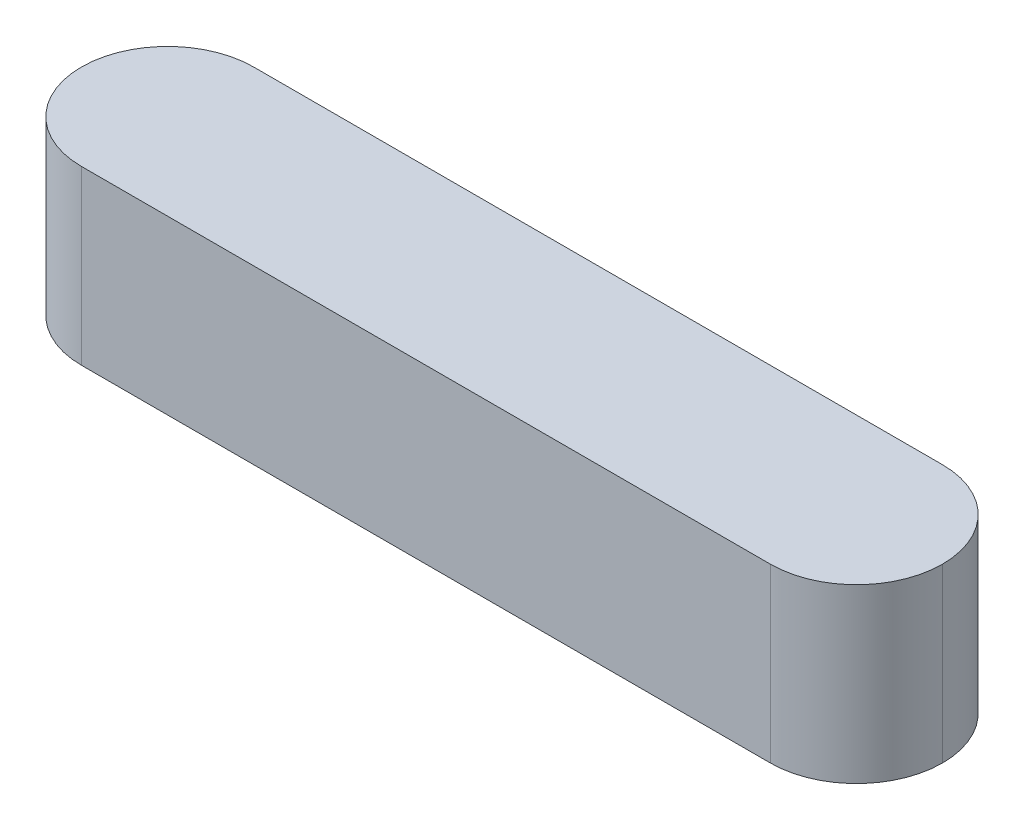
ISO-10303-21;
HEADER;
FILE_DESCRIPTION(('STEP AP214'),'2;1');
FILE_NAME('part.step','',(''),(''),'','','');
FILE_SCHEMA(('AUTOMOTIVE_DESIGN { 1 0 10303 214 1 1 1 1 }'));
ENDSEC;
DATA;
#1=APPLICATION_CONTEXT('core data for automotive mechanical design processes');
#2=APPLICATION_PROTOCOL_DEFINITION('international standard','automotive_design',2000,#1);
#3=PRODUCT_CONTEXT('',#1,'mechanical');
#4=PRODUCT('Part','Part','',(#3));
#5=PRODUCT_RELATED_PRODUCT_CATEGORY('part','',(#4));
#6=PRODUCT_DEFINITION_FORMATION('','',#4);
#7=PRODUCT_DEFINITION_CONTEXT('part definition',#1,'design');
#8=PRODUCT_DEFINITION('design','',#6,#7);
#9=PRODUCT_DEFINITION_SHAPE('','',#8);
#10=(LENGTH_UNIT() NAMED_UNIT(*) SI_UNIT(.MILLI.,.METRE.));
#11=(NAMED_UNIT(*) PLANE_ANGLE_UNIT() SI_UNIT($,.RADIAN.));
#12=(NAMED_UNIT(*) SI_UNIT($,.STERADIAN.) SOLID_ANGLE_UNIT());
#13=UNCERTAINTY_MEASURE_WITH_UNIT(LENGTH_MEASURE(1.E-05),#10,'distance_accuracy_value','');
#14=(GEOMETRIC_REPRESENTATION_CONTEXT(3) GLOBAL_UNCERTAINTY_ASSIGNED_CONTEXT((#13)) GLOBAL_UNIT_ASSIGNED_CONTEXT((#10,
#11,#12)) REPRESENTATION_CONTEXT('',''));
#15=CARTESIAN_POINT('',(0.,0.,0.));
#16=DIRECTION('',(0.,0.,1.));
#17=DIRECTION('',(1.,0.,0.));
#18=AXIS2_PLACEMENT_3D('',#15,#16,#17);
#19=CARTESIAN_POINT('',(-7.5,3.,-1.5));
#20=DIRECTION('',(0.,0.,1.));
#21=DIRECTION('',(1.,0.,0.));
#22=AXIS2_PLACEMENT_3D('',#19,#20,#21);
#23=PLANE('',#22);
#24=DIRECTION('',(-1.,0.,0.));
#25=VECTOR('',#24,1.);
#26=CARTESIAN_POINT('',(-7.5,0.,-1.5));
#27=LINE('',#26,#25);
#28=CARTESIAN_POINT('',(6.,0.,-1.5));
#29=VERTEX_POINT('',#28);
#30=CARTESIAN_POINT('',(-6.,0.,-1.5));
#31=VERTEX_POINT('',#30);
#32=EDGE_CURVE('E116',#29,#31,#27,.T.);
#33=ORIENTED_EDGE('',*,*,#32,.T.);
#34=DIRECTION('',(0.,-1.,0.));
#35=VECTOR('',#34,1.);
#36=CARTESIAN_POINT('',(-6.,3.,-1.5));
#37=LINE('',#36,#35);
#38=CARTESIAN_POINT('',(-6.,3.,-1.5));
#39=VERTEX_POINT('',#38);
#40=EDGE_CURVE('E11',#31,#39,#37,.F.);
#41=ORIENTED_EDGE('',*,*,#40,.T.);
#42=DIRECTION('',(-1.,0.,0.));
#43=VECTOR('',#42,1.);
#44=CARTESIAN_POINT('',(-7.5,3.,-1.5));
#45=LINE('',#44,#43);
#46=CARTESIAN_POINT('',(6.,3.,-1.5));
#47=VERTEX_POINT('',#46);
#48=EDGE_CURVE('E115',#47,#39,#45,.T.);
#49=ORIENTED_EDGE('',*,*,#48,.F.);
#50=DIRECTION('',(0.,-1.,0.));
#51=VECTOR('',#50,1.);
#52=CARTESIAN_POINT('',(6.,3.,-1.5));
#53=LINE('',#52,#51);
#54=EDGE_CURVE('E44',#47,#29,#53,.T.);
#55=ORIENTED_EDGE('',*,*,#54,.T.);
#56=EDGE_LOOP('',(#33,#41,#49,#55));
#57=FACE_BOUND('',#56,.T.);
#58=ADVANCED_FACE('F35',(#57),#23,.F.);
#59=CARTESIAN_POINT('',(-7.5,3.,1.5));
#60=DIRECTION('',(0.,0.,-1.));
#61=DIRECTION('',(-1.,0.,0.));
#62=AXIS2_PLACEMENT_3D('',#59,#60,#61);
#63=PLANE('',#62);
#64=DIRECTION('',(1.,0.,0.));
#65=VECTOR('',#64,1.);
#66=CARTESIAN_POINT('',(-7.5,3.,1.5));
#67=LINE('',#66,#65);
#68=CARTESIAN_POINT('',(-6.,3.,1.5));
#69=VERTEX_POINT('',#68);
#70=CARTESIAN_POINT('',(6.,3.,1.5));
#71=VERTEX_POINT('',#70);
#72=EDGE_CURVE('E109',#69,#71,#67,.T.);
#73=ORIENTED_EDGE('',*,*,#72,.F.);
#74=DIRECTION('',(0.,-1.,0.));
#75=VECTOR('',#74,1.);
#76=CARTESIAN_POINT('',(-6.,3.,1.5));
#77=LINE('',#76,#75);
#78=CARTESIAN_POINT('',(-6.,0.,1.5));
#79=VERTEX_POINT('',#78);
#80=EDGE_CURVE('E94',#69,#79,#77,.T.);
#81=ORIENTED_EDGE('',*,*,#80,.T.);
#82=DIRECTION('',(1.,0.,0.));
#83=VECTOR('',#82,1.);
#84=CARTESIAN_POINT('',(-7.5,0.,1.5));
#85=LINE('',#84,#83);
#86=CARTESIAN_POINT('',(6.,0.,1.5));
#87=VERTEX_POINT('',#86);
#88=EDGE_CURVE('E106',#79,#87,#85,.T.);
#89=ORIENTED_EDGE('',*,*,#88,.T.);
#90=DIRECTION('',(0.,-1.,0.));
#91=VECTOR('',#90,1.);
#92=CARTESIAN_POINT('',(6.,3.,1.5));
#93=LINE('',#92,#91);
#94=EDGE_CURVE('E111',#87,#71,#93,.F.);
#95=ORIENTED_EDGE('',*,*,#94,.T.);
#96=EDGE_LOOP('',(#73,#81,#89,#95));
#97=FACE_BOUND('',#96,.T.);
#98=ADVANCED_FACE('F105',(#97),#63,.F.);
#99=CARTESIAN_POINT('',(0.,3.,0.));
#100=DIRECTION('',(0.,-1.,0.));
#101=DIRECTION('',(0.,0.,-1.));
#102=AXIS2_PLACEMENT_3D('',#99,#100,#101);
#103=PLANE('',#102);
#104=CARTESIAN_POINT('',(-6.,3.,0.));
#105=DIRECTION('',(0.,-1.,0.));
#106=DIRECTION('',(0.,0.,-1.));
#107=AXIS2_PLACEMENT_3D('',#104,#105,#106);
#108=CIRCLE('',#107,1.5);
#109=CARTESIAN_POINT('',(-7.5,3.,0.));
#110=VERTEX_POINT('',#109);
#111=EDGE_CURVE('E52',#39,#110,#108,.F.);
#112=ORIENTED_EDGE('',*,*,#111,.T.);
#113=CARTESIAN_POINT('',(-6.,3.,0.));
#114=DIRECTION('',(0.,-1.,0.));
#115=DIRECTION('',(0.,0.,-1.));
#116=AXIS2_PLACEMENT_3D('',#113,#114,#115);
#117=CIRCLE('',#116,1.5);
#118=EDGE_CURVE('E131',#110,#69,#117,.F.);
#119=ORIENTED_EDGE('',*,*,#118,.T.);
#120=ORIENTED_EDGE('',*,*,#72,.T.);
#121=CARTESIAN_POINT('',(6.,3.,0.));
#122=DIRECTION('',(0.,-1.,0.));
#123=DIRECTION('',(0.,0.,-1.));
#124=AXIS2_PLACEMENT_3D('',#121,#122,#123);
#125=CIRCLE('',#124,1.5);
#126=CARTESIAN_POINT('',(7.5,3.,0.));
#127=VERTEX_POINT('',#126);
#128=EDGE_CURVE('E99',#71,#127,#125,.F.);
#129=ORIENTED_EDGE('',*,*,#128,.T.);
#130=CARTESIAN_POINT('',(6.,3.,0.));
#131=DIRECTION('',(0.,-1.,0.));
#132=DIRECTION('',(0.,0.,-1.));
#133=AXIS2_PLACEMENT_3D('',#130,#131,#132);
#134=CIRCLE('',#133,1.5);
#135=EDGE_CURVE('E128',#127,#47,#134,.F.);
#136=ORIENTED_EDGE('',*,*,#135,.T.);
#137=ORIENTED_EDGE('',*,*,#48,.T.);
#138=EDGE_LOOP('',(#112,#119,#120,#129,#136,#137));
#139=FACE_BOUND('',#138,.T.);
#140=ADVANCED_FACE('F142',(#139),#103,.F.);
#141=CARTESIAN_POINT('',(0.,0.,0.));
#142=DIRECTION('',(0.,-1.,0.));
#143=DIRECTION('',(0.,0.,-1.));
#144=AXIS2_PLACEMENT_3D('',#141,#142,#143);
#145=PLANE('',#144);
#146=ORIENTED_EDGE('',*,*,#88,.F.);
#147=CARTESIAN_POINT('',(-6.,0.,0.));
#148=DIRECTION('',(0.,-1.,0.));
#149=DIRECTION('',(0.,0.,-1.));
#150=AXIS2_PLACEMENT_3D('',#147,#148,#149);
#151=CIRCLE('',#150,1.5);
#152=CARTESIAN_POINT('',(-7.5,0.,0.));
#153=VERTEX_POINT('',#152);
#154=EDGE_CURVE('E90',#79,#153,#151,.T.);
#155=ORIENTED_EDGE('',*,*,#154,.T.);
#156=CARTESIAN_POINT('',(-6.,0.,0.));
#157=DIRECTION('',(0.,-1.,0.));
#158=DIRECTION('',(0.,0.,-1.));
#159=AXIS2_PLACEMENT_3D('',#156,#157,#158);
#160=CIRCLE('',#159,1.5);
#161=EDGE_CURVE('E100',#153,#31,#160,.T.);
#162=ORIENTED_EDGE('',*,*,#161,.T.);
#163=ORIENTED_EDGE('',*,*,#32,.F.);
#164=CARTESIAN_POINT('',(6.,0.,0.));
#165=DIRECTION('',(0.,-1.,0.));
#166=DIRECTION('',(0.,0.,-1.));
#167=AXIS2_PLACEMENT_3D('',#164,#165,#166);
#168=CIRCLE('',#167,1.5);
#169=CARTESIAN_POINT('',(7.5,0.,0.));
#170=VERTEX_POINT('',#169);
#171=EDGE_CURVE('E124',#29,#170,#168,.T.);
#172=ORIENTED_EDGE('',*,*,#171,.T.);
#173=CARTESIAN_POINT('',(6.,0.,0.));
#174=DIRECTION('',(0.,-1.,0.));
#175=DIRECTION('',(0.,0.,-1.));
#176=AXIS2_PLACEMENT_3D('',#173,#174,#175);
#177=CIRCLE('',#176,1.5);
#178=EDGE_CURVE('E110',#170,#87,#177,.T.);
#179=ORIENTED_EDGE('',*,*,#178,.T.);
#180=EDGE_LOOP('',(#146,#155,#162,#163,#172,#179));
#181=FACE_BOUND('',#180,.T.);
#182=ADVANCED_FACE('F113',(#181),#145,.T.);
#183=CARTESIAN_POINT('',(-6.,3.,0.));
#184=DIRECTION('',(0.,-1.,0.));
#185=DIRECTION('',(0.,0.,-1.));
#186=AXIS2_PLACEMENT_3D('',#183,#184,#185);
#187=CYLINDRICAL_SURFACE('',#186,1.5);
#188=DIRECTION('',(0.,-1.,0.));
#189=VECTOR('',#188,1.);
#190=CARTESIAN_POINT('',(-7.5,3.,0.));
#191=LINE('',#190,#189);
#192=EDGE_CURVE('E95',#110,#153,#191,.T.);
#193=ORIENTED_EDGE('',*,*,#192,.F.);
#194=ORIENTED_EDGE('',*,*,#111,.F.);
#195=ORIENTED_EDGE('',*,*,#40,.F.);
#196=ORIENTED_EDGE('',*,*,#161,.F.);
#197=EDGE_LOOP('',(#193,#194,#195,#196));
#198=FACE_BOUND('',#197,.T.);
#199=ADVANCED_FACE('F145',(#198),#187,.T.);
#200=CARTESIAN_POINT('',(-6.,3.,0.));
#201=DIRECTION('',(0.,-1.,0.));
#202=DIRECTION('',(0.,0.,-1.));
#203=AXIS2_PLACEMENT_3D('',#200,#201,#202);
#204=CYLINDRICAL_SURFACE('',#203,1.5);
#205=ORIENTED_EDGE('',*,*,#118,.F.);
#206=ORIENTED_EDGE('',*,*,#192,.T.);
#207=ORIENTED_EDGE('',*,*,#154,.F.);
#208=ORIENTED_EDGE('',*,*,#80,.F.);
#209=EDGE_LOOP('',(#205,#206,#207,#208));
#210=FACE_BOUND('',#209,.T.);
#211=ADVANCED_FACE('F93',(#210),#204,.T.);
#212=CARTESIAN_POINT('',(6.,3.,0.));
#213=DIRECTION('',(0.,-1.,0.));
#214=DIRECTION('',(0.,0.,-1.));
#215=AXIS2_PLACEMENT_3D('',#212,#213,#214);
#216=CYLINDRICAL_SURFACE('',#215,1.5);
#217=DIRECTION('',(0.,-1.,0.));
#218=VECTOR('',#217,1.);
#219=CARTESIAN_POINT('',(7.5,3.,0.));
#220=LINE('',#219,#218);
#221=EDGE_CURVE('E39',#127,#170,#220,.T.);
#222=ORIENTED_EDGE('',*,*,#221,.F.);
#223=ORIENTED_EDGE('',*,*,#128,.F.);
#224=ORIENTED_EDGE('',*,*,#94,.F.);
#225=ORIENTED_EDGE('',*,*,#178,.F.);
#226=EDGE_LOOP('',(#222,#223,#224,#225));
#227=FACE_BOUND('',#226,.T.);
#228=ADVANCED_FACE('F37',(#227),#216,.T.);
#229=CARTESIAN_POINT('',(6.,3.,0.));
#230=DIRECTION('',(0.,-1.,0.));
#231=DIRECTION('',(0.,0.,-1.));
#232=AXIS2_PLACEMENT_3D('',#229,#230,#231);
#233=CYLINDRICAL_SURFACE('',#232,1.5);
#234=ORIENTED_EDGE('',*,*,#135,.F.);
#235=ORIENTED_EDGE('',*,*,#221,.T.);
#236=ORIENTED_EDGE('',*,*,#171,.F.);
#237=ORIENTED_EDGE('',*,*,#54,.F.);
#238=EDGE_LOOP('',(#234,#235,#236,#237));
#239=FACE_BOUND('',#238,.T.);
#240=ADVANCED_FACE('F138',(#239),#233,.T.);
#241=CLOSED_SHELL('',(#58,#98,#140,#182,#199,#211,#228,#240));
#242=MANIFOLD_SOLID_BREP('B2',#241);
#243=ADVANCED_BREP_SHAPE_REPRESENTATION('',(#18,#242),#14);
#244=SHAPE_DEFINITION_REPRESENTATION(#9,#243);
ENDSEC;
END-ISO-10303-21;
